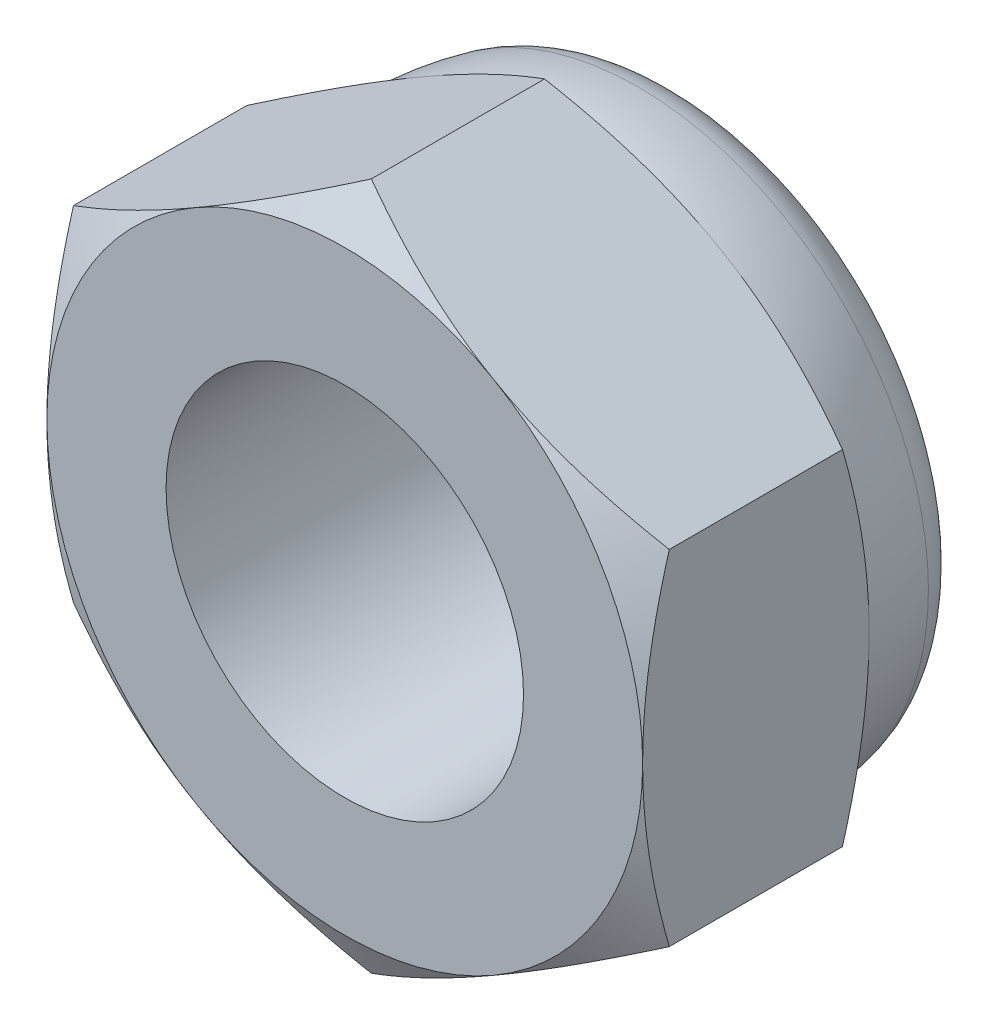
ISO-10303-21;
HEADER;
FILE_DESCRIPTION(('STEP AP214'),'2;1');
FILE_NAME('part.step','',(''),(''),'','','');
FILE_SCHEMA(('AUTOMOTIVE_DESIGN { 1 0 10303 214 1 1 1 1 }'));
ENDSEC;
DATA;
#1=APPLICATION_CONTEXT('core data for automotive mechanical design processes');
#2=APPLICATION_PROTOCOL_DEFINITION('international standard','automotive_design',2000,#1);
#3=PRODUCT_CONTEXT('',#1,'mechanical');
#4=PRODUCT('Part','Part','',(#3));
#5=PRODUCT_RELATED_PRODUCT_CATEGORY('part','',(#4));
#6=PRODUCT_DEFINITION_FORMATION('','',#4);
#7=PRODUCT_DEFINITION_CONTEXT('part definition',#1,'design');
#8=PRODUCT_DEFINITION('design','',#6,#7);
#9=PRODUCT_DEFINITION_SHAPE('','',#8);
#10=(LENGTH_UNIT() NAMED_UNIT(*) SI_UNIT(.MILLI.,.METRE.));
#11=(NAMED_UNIT(*) PLANE_ANGLE_UNIT() SI_UNIT($,.RADIAN.));
#12=(NAMED_UNIT(*) SI_UNIT($,.STERADIAN.) SOLID_ANGLE_UNIT());
#13=UNCERTAINTY_MEASURE_WITH_UNIT(LENGTH_MEASURE(1.E-05),#10,'distance_accuracy_value','');
#14=(GEOMETRIC_REPRESENTATION_CONTEXT(3) GLOBAL_UNCERTAINTY_ASSIGNED_CONTEXT((#13)) GLOBAL_UNIT_ASSIGNED_CONTEXT((#10,
#11,#12)) REPRESENTATION_CONTEXT('',''));
#15=CARTESIAN_POINT('',(0.,0.,0.));
#16=DIRECTION('',(0.,0.,1.));
#17=DIRECTION('',(1.,0.,0.));
#18=AXIS2_PLACEMENT_3D('',#15,#16,#17);
#19=CARTESIAN_POINT('',(0.,0.,-5.7));
#20=DIRECTION('',(0.,0.,1.));
#21=DIRECTION('',(1.,0.,0.));
#22=AXIS2_PLACEMENT_3D('',#19,#20,#21);
#23=CYLINDRICAL_SURFACE('',#22,3.);
#24=CARTESIAN_POINT('',(0.,0.,0.));
#25=DIRECTION('',(0.,0.,1.));
#26=DIRECTION('',(1.,0.,0.));
#27=AXIS2_PLACEMENT_3D('',#24,#25,#26);
#28=CIRCLE('',#27,3.);
#29=CARTESIAN_POINT('',(3.,0.,0.));
#30=VERTEX_POINT('',#29);
#31=EDGE_CURVE('E161',#30,#30,#28,.T.);
#32=ORIENTED_EDGE('',*,*,#31,.T.);
#33=EDGE_LOOP('',(#32));
#34=FACE_BOUND('',#33,.T.);
#35=CARTESIAN_POINT('',(0.,0.,-4.3));
#36=DIRECTION('',(0.,0.,-1.));
#37=DIRECTION('',(-1.,0.,0.));
#38=AXIS2_PLACEMENT_3D('',#35,#36,#37);
#39=CIRCLE('',#38,3.);
#40=CARTESIAN_POINT('',(-3.,0.,-4.3));
#41=VERTEX_POINT('',#40);
#42=EDGE_CURVE('E11',#41,#41,#39,.F.);
#43=ORIENTED_EDGE('',*,*,#42,.F.);
#44=EDGE_LOOP('',(#43));
#45=FACE_BOUND('',#44,.T.);
#46=ADVANCED_FACE('F34',(#34,#45),#23,.F.);
#47=CARTESIAN_POINT('',(-5.,8.66025403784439,0.));
#48=DIRECTION('',(0.,0.,-1.));
#49=DIRECTION('',(-1.,0.,0.));
#50=AXIS2_PLACEMENT_3D('',#47,#48,#49);
#51=PLANE('',#50);
#52=ORIENTED_EDGE('',*,*,#31,.F.);
#53=EDGE_LOOP('',(#52));
#54=FACE_BOUND('',#53,.T.);
#55=CARTESIAN_POINT('',(0.,0.,0.));
#56=DIRECTION('',(0.,0.,-1.));
#57=DIRECTION('',(-1.,0.,0.));
#58=AXIS2_PLACEMENT_3D('',#55,#56,#57);
#59=CIRCLE('',#58,5.);
#60=CARTESIAN_POINT('',(-5.,0.,0.));
#61=VERTEX_POINT('',#60);
#62=CARTESIAN_POINT('',(-2.5,4.3301270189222,0.));
#63=VERTEX_POINT('',#62);
#64=EDGE_CURVE('E160',#61,#63,#59,.T.);
#65=ORIENTED_EDGE('',*,*,#64,.F.);
#66=CARTESIAN_POINT('',(0.,0.,0.));
#67=DIRECTION('',(0.,0.,-1.));
#68=DIRECTION('',(-1.,0.,0.));
#69=AXIS2_PLACEMENT_3D('',#66,#67,#68);
#70=CIRCLE('',#69,5.);
#71=CARTESIAN_POINT('',(-2.5,-4.3301270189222,0.));
#72=VERTEX_POINT('',#71);
#73=EDGE_CURVE('E148',#61,#72,#70,.F.);
#74=ORIENTED_EDGE('',*,*,#73,.T.);
#75=CARTESIAN_POINT('',(2.5,-4.3301270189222,0.));
#76=VERTEX_POINT('',#75);
#77=EDGE_CURVE('E266',#72,#76,#70,.F.);
#78=ORIENTED_EDGE('',*,*,#77,.T.);
#79=CARTESIAN_POINT('',(5.,0.,0.));
#80=VERTEX_POINT('',#79);
#81=EDGE_CURVE('E557',#76,#80,#70,.F.);
#82=ORIENTED_EDGE('',*,*,#81,.T.);
#83=CARTESIAN_POINT('',(2.5,4.3301270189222,0.));
#84=VERTEX_POINT('',#83);
#85=EDGE_CURVE('E556',#80,#84,#70,.F.);
#86=ORIENTED_EDGE('',*,*,#85,.T.);
#87=EDGE_CURVE('E252',#84,#63,#70,.F.);
#88=ORIENTED_EDGE('',*,*,#87,.T.);
#89=EDGE_LOOP('',(#65,#74,#78,#82,#86,#88));
#90=FACE_BOUND('',#89,.T.);
#91=ADVANCED_FACE('F190',(#54,#90),#51,.F.);
#92=CARTESIAN_POINT('',(0.,0.,0.));
#93=DIRECTION('',(0.,0.,-1.));
#94=DIRECTION('',(-1.,0.,0.));
#95=AXIS2_PLACEMENT_3D('',#92,#93,#94);
#96=CONICAL_SURFACE('',#95,5.,1.0471975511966);
#97=CARTESIAN_POINT('',(-5.,-7.85952446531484,-2.49135627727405));
#98=CARTESIAN_POINT('',(-5.,-7.64024119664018,-2.38456490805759));
#99=CARTESIAN_POINT('',(-5.,-7.42046573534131,-2.27876743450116));
#100=CARTESIAN_POINT('',(-5.,-6.97966908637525,-2.06971720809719));
#101=CARTESIAN_POINT('',(-5.,-6.75864771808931,-1.9664648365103));
#102=CARTESIAN_POINT('',(-5.,-6.31400877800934,-1.76256455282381));
#103=CARTESIAN_POINT('',(-5.,-6.09038368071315,-1.66193299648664));
#104=CARTESIAN_POINT('',(-5.,-5.64139140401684,-1.46464945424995));
#105=CARTESIAN_POINT('',(-5.,-5.41602430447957,-1.36799728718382));
#106=CARTESIAN_POINT('',(-5.,-4.95550995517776,-1.17652649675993));
#107=CARTESIAN_POINT('',(-5.,-4.72029024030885,-1.08188123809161));
#108=CARTESIAN_POINT('',(-5.,-4.2471379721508,-0.89950202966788));
#109=CARTESIAN_POINT('',(-5.,-4.00920512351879,-0.811768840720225));
#110=CARTESIAN_POINT('',(-5.,-3.53066047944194,-0.645440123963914));
#111=CARTESIAN_POINT('',(-5.,-3.29005487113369,-0.566826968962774));
#112=CARTESIAN_POINT('',(-5.,-2.80539335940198,-0.421191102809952));
#113=CARTESIAN_POINT('',(-5.,-2.5613385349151,-0.354164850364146));
#114=CARTESIAN_POINT('',(-5.,-2.07102262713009,-0.235213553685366));
#115=CARTESIAN_POINT('',(-5.,-1.82478280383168,-0.183202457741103));
#116=CARTESIAN_POINT('',(-5.,-1.3291329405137,-0.0971416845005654));
#117=CARTESIAN_POINT('',(-5.,-1.07972323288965,-0.0630901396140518));
#118=CARTESIAN_POINT('',(-5.,-0.582278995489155,-0.0161056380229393));
#119=CARTESIAN_POINT('',(-5.,-0.33427154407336,-0.00289307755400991));
#120=CARTESIAN_POINT('',(-5.,0.161980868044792,0.00203623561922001));
#121=CARTESIAN_POINT('',(-5.,0.410225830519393,-0.00624717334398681));
#122=CARTESIAN_POINT('',(-5.,0.828609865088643,-0.0377266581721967));
#123=CARTESIAN_POINT('',(-5.,0.999182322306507,-0.0555241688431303));
#124=CARTESIAN_POINT('',(-5.,1.33913929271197,-0.100215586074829));
#125=CARTESIAN_POINT('',(-5.,1.50852365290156,-0.127110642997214));
#126=CARTESIAN_POINT('',(-5.,2.01463578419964,-0.220034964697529));
#127=CARTESIAN_POINT('',(-5.,2.34914750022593,-0.298288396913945));
#128=CARTESIAN_POINT('',(-5.,2.84947055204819,-0.43475362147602));
#129=CARTESIAN_POINT('',(-5.,3.01785451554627,-0.484077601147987));
#130=CARTESIAN_POINT('',(-5.,3.35298887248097,-0.588042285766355));
#131=CARTESIAN_POINT('',(-5.,3.51973925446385,-0.642683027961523));
#132=CARTESIAN_POINT('',(-5.,3.851655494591,-0.756388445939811));
#133=CARTESIAN_POINT('',(-5.,4.01682180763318,-0.815451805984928));
#134=CARTESIAN_POINT('',(-5.,4.34577319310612,-0.937288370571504));
#135=CARTESIAN_POINT('',(-5.,4.50955828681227,-1.00006151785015));
#136=CARTESIAN_POINT('',(-5.,4.9145081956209,-1.1596926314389));
#137=CARTESIAN_POINT('',(-5.,5.15494160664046,-1.25840324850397));
#138=CARTESIAN_POINT('',(-5.,5.63359045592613,-1.46107987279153));
#139=CARTESIAN_POINT('',(-5.,5.87180571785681,-1.56504629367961));
#140=CARTESIAN_POINT('',(-5.,6.34645664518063,-1.77711400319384));
#141=CARTESIAN_POINT('',(-5.,6.58289183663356,-1.88521634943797));
#142=CARTESIAN_POINT('',(-5.,7.05424983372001,-2.10467573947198));
#143=CARTESIAN_POINT('',(-5.,7.28917260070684,-2.216032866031));
#144=CARTESIAN_POINT('',(-5.,7.75806132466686,-2.44149585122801));
#145=CARTESIAN_POINT('',(-5.,7.99202568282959,-2.55560502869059));
#146=CARTESIAN_POINT('',(-5.,8.45890841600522,-2.78594562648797));
#147=CARTESIAN_POINT('',(-5.,8.69182678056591,-2.90217706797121));
#148=CARTESIAN_POINT('',(-5.,9.38919926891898,-3.25342076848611));
#149=CARTESIAN_POINT('',(-5.,9.85234973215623,-3.49102070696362));
#150=CARTESIAN_POINT('',(-5.,10.7338003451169,-3.94896948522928));
#151=CARTESIAN_POINT('',(-5.,11.1523179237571,-4.16890179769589));
#152=CARTESIAN_POINT('',(-5.,11.987820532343,-4.61170154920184));
#153=CARTESIAN_POINT('',(-5.,12.4048054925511,-4.83456911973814));
#154=CARTESIAN_POINT('',(-5.,13.2363852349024,-5.28186905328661));
#155=CARTESIAN_POINT('',(-5.,13.6509834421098,-5.50629505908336));
#156=CARTESIAN_POINT('',(-5.,14.4792101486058,-5.95686657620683));
#157=CARTESIAN_POINT('',(-5.,14.8928387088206,-6.18301197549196));
#158=CARTESIAN_POINT('',(-5.,15.30611626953,-6.40979272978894));
#159=B_SPLINE_CURVE_WITH_KNOTS('',3,(#97,#98,#99,#100,#101,#102,#103,#104,#105,#106,#107,#108,
#109,#110,#111,#112,#113,#114,#115,#116,#117,#118,#119,#120,#121,#122,#123,#124,#125,#126,#127,
#128,#129,#130,#131,#132,#133,#134,#135,#136,#137,#138,#139,#140,#141,#142,#143,#144,#145,#146,
#147,#148,#149,#150,#151,#152,#153,#154,#155,#156,#157,#158),.UNSPECIFIED.,.F.,.F.,(4,2,2,2,2,2,
2,2,2,2,2,2,2,2,2,2,2,2,2,2,2,2,2,2,2,2,2,2,2,2,4),(0.,0.731722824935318,1.46355460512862,
2.19919601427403,2.93480389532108,3.69536062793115,4.45600095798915,5.21514572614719,
5.97405806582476,6.72853058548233,7.48292463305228,8.22710789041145,8.97129674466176,
9.48554450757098,9.99985732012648,11.0290077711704,11.5553386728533,12.0816732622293,
12.607851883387,13.1340223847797,13.9136581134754,14.6933553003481,15.473253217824,
16.2531709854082,17.034081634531,17.8150000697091,19.3765737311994,20.7949213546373,
22.2133327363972,23.6276580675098,25.0418920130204),.UNSPECIFIED.);
#160=CARTESIAN_POINT('',(-5.,2.88675134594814,-0.446581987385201));
#161=VERTEX_POINT('',#160);
#162=EDGE_CURVE('E177',#161,#61,#159,.F.);
#163=ORIENTED_EDGE('',*,*,#162,.T.);
#164=ORIENTED_EDGE('',*,*,#64,.T.);
#165=CARTESIAN_POINT('',(0.0002,5.7736181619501,-0.446648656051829));
#166=CARTESIAN_POINT('',(-0.219534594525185,5.64675433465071,-0.373386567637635));
#167=CARTESIAN_POINT('',(-0.441148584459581,5.5188054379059,-0.306751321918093));
#168=CARTESIAN_POINT('',(-0.888213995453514,5.26069210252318,-0.190438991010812));
#169=CARTESIAN_POINT('',(-1.11367335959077,5.13052307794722,-0.140803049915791));
#170=CARTESIAN_POINT('',(-1.56183230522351,4.87177839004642,-0.063551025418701));
#171=CARTESIAN_POINT('',(-1.78446209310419,4.74324302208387,-0.035420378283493));
#172=CARTESIAN_POINT('',(-2.11918990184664,4.54998783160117,-0.0101949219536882));
#173=CARTESIAN_POINT('',(-2.23084219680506,4.48552534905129,-0.00461345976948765));
#174=CARTESIAN_POINT('',(-2.4542499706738,4.35654081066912,0.000797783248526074));
#175=CARTESIAN_POINT('',(-2.56600544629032,4.29201875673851,0.000627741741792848));
#176=CARTESIAN_POINT('',(-2.87218423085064,4.11524635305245,-0.00775363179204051));
#177=CARTESIAN_POINT('',(-3.06650608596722,4.00305457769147,-0.0218297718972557));
#178=CARTESIAN_POINT('',(-3.45386010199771,3.77941563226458,-0.0664652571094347));
#179=CARTESIAN_POINT('',(-3.64689090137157,3.66796924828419,-0.0970398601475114));
#180=CARTESIAN_POINT('',(-4.03502534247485,3.44387972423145,-0.173468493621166));
#181=CARTESIAN_POINT('',(-4.23007999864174,3.33126486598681,-0.219646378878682));
#182=CARTESIAN_POINT('',(-4.61728034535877,3.10771464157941,-0.324451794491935));
#183=CARTESIAN_POINT('',(-4.80943099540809,2.99677641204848,-0.383054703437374));
#184=CARTESIAN_POINT('',(-5.0002,2.8866358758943,-0.446648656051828));
#185=B_SPLINE_CURVE_WITH_KNOTS('',3,(#165,#166,#167,#168,#169,#170,#171,#172,#173,#174,#175,
#176,#177,#178,#179,#180,#181,#182,#183,#184),.UNSPECIFIED.,.F.,.F.,(4,2,2,2,2,2,2,2,2,4),(0.,
0.79255584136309,1.58701660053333,2.36181537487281,2.74884076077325,3.13585419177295,
3.80962362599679,4.48401723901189,5.17336882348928,5.86136694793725),.UNSPECIFIED.);
#186=EDGE_CURVE('E164',#63,#161,#185,.T.);
#187=ORIENTED_EDGE('',*,*,#186,.T.);
#188=EDGE_LOOP('',(#163,#164,#187));
#189=FACE_BOUND('',#188,.T.);
#190=ADVANCED_FACE('F184',(#189),#96,.T.);
#191=CARTESIAN_POINT('',(5.0002,2.8866358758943,-0.446648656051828));
#192=CARTESIAN_POINT('',(4.78046540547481,3.01349970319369,-0.373386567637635));
#193=CARTESIAN_POINT('',(4.55885141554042,3.1414485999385,-0.306751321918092));
#194=CARTESIAN_POINT('',(4.11178600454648,3.39956193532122,-0.190438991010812));
#195=CARTESIAN_POINT('',(3.88632664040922,3.52973095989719,-0.140803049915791));
#196=CARTESIAN_POINT('',(3.43816769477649,3.78847564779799,-0.063551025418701));
#197=CARTESIAN_POINT('',(3.2155379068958,3.91701101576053,-0.035420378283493));
#198=CARTESIAN_POINT('',(2.88081009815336,4.11026620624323,-0.0101949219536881));
#199=CARTESIAN_POINT('',(2.76915780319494,4.17472868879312,-0.00461345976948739));
#200=CARTESIAN_POINT('',(2.5457500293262,4.30371322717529,0.000797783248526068));
#201=CARTESIAN_POINT('',(2.43399455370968,4.3682352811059,0.000627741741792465));
#202=CARTESIAN_POINT('',(2.12781576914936,4.54500768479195,-0.00775363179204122));
#203=CARTESIAN_POINT('',(1.93349391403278,4.65719946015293,-0.0218297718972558));
#204=CARTESIAN_POINT('',(1.54613989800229,4.88083840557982,-0.0664652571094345));
#205=CARTESIAN_POINT('',(1.35310909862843,4.99228478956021,-0.0970398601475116));
#206=CARTESIAN_POINT('',(0.964974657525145,5.21637431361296,-0.173468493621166));
#207=CARTESIAN_POINT('',(0.769920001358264,5.32898917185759,-0.219646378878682));
#208=CARTESIAN_POINT('',(0.382719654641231,5.55253939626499,-0.324451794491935));
#209=CARTESIAN_POINT('',(0.190569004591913,5.66347762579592,-0.383054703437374));
#210=CARTESIAN_POINT('',(-0.000199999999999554,5.7736181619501,-0.446648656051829));
#211=B_SPLINE_CURVE_WITH_KNOTS('',3,(#191,#192,#193,#194,#195,#196,#197,#198,#199,#200,#201,
#202,#203,#204,#205,#206,#207,#208,#209,#210),.UNSPECIFIED.,.F.,.F.,(4,2,2,2,2,2,2,2,2,4),(0.,
0.792555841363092,1.58701660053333,2.36181537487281,2.74884076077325,3.13585419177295,
3.80962362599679,4.48401723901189,5.17336882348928,5.86136694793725),.UNSPECIFIED.);
#212=CARTESIAN_POINT('',(0.,5.77350269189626,-0.446581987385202));
#213=VERTEX_POINT('',#212);
#214=EDGE_CURVE('E202',#84,#213,#211,.T.);
#215=ORIENTED_EDGE('',*,*,#214,.T.);
#216=EDGE_CURVE('E176',#213,#63,#185,.T.);
#217=ORIENTED_EDGE('',*,*,#216,.T.);
#218=ORIENTED_EDGE('',*,*,#87,.F.);
#219=EDGE_LOOP('',(#215,#217,#218));
#220=FACE_BOUND('',#219,.T.);
#221=ADVANCED_FACE('F189',(#220),#96,.T.);
#222=CARTESIAN_POINT('',(5.,-7.85952446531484,-2.49135627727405));
#223=CARTESIAN_POINT('',(5.,-7.64024119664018,-2.38456490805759));
#224=CARTESIAN_POINT('',(5.,-7.42046573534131,-2.27876743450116));
#225=CARTESIAN_POINT('',(5.,-6.97966908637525,-2.06971720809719));
#226=CARTESIAN_POINT('',(5.,-6.75864771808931,-1.9664648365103));
#227=CARTESIAN_POINT('',(5.,-6.31400877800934,-1.76256455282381));
#228=CARTESIAN_POINT('',(5.,-6.09038368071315,-1.66193299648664));
#229=CARTESIAN_POINT('',(5.,-5.64139140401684,-1.46464945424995));
#230=CARTESIAN_POINT('',(5.,-5.41602430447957,-1.36799728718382));
#231=CARTESIAN_POINT('',(5.,-4.95550995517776,-1.17652649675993));
#232=CARTESIAN_POINT('',(5.,-4.72029024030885,-1.08188123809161));
#233=CARTESIAN_POINT('',(5.,-4.2471379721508,-0.89950202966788));
#234=CARTESIAN_POINT('',(5.,-4.00920512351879,-0.811768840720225));
#235=CARTESIAN_POINT('',(5.,-3.53066047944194,-0.645440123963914));
#236=CARTESIAN_POINT('',(5.,-3.29005487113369,-0.566826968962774));
#237=CARTESIAN_POINT('',(5.,-2.80539335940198,-0.421191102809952));
#238=CARTESIAN_POINT('',(5.,-2.5613385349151,-0.354164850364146));
#239=CARTESIAN_POINT('',(5.,-2.07102262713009,-0.235213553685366));
#240=CARTESIAN_POINT('',(5.,-1.82478280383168,-0.183202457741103));
#241=CARTESIAN_POINT('',(5.,-1.3291329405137,-0.0971416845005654));
#242=CARTESIAN_POINT('',(5.,-1.07972323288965,-0.0630901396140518));
#243=CARTESIAN_POINT('',(5.,-0.582278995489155,-0.0161056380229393));
#244=CARTESIAN_POINT('',(5.,-0.33427154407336,-0.00289307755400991));
#245=CARTESIAN_POINT('',(5.,0.161980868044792,0.00203623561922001));
#246=CARTESIAN_POINT('',(5.,0.410225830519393,-0.00624717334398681));
#247=CARTESIAN_POINT('',(5.,0.828609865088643,-0.0377266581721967));
#248=CARTESIAN_POINT('',(5.,0.999182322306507,-0.0555241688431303));
#249=CARTESIAN_POINT('',(5.,1.33913929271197,-0.100215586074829));
#250=CARTESIAN_POINT('',(5.,1.50852365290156,-0.127110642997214));
#251=CARTESIAN_POINT('',(5.,2.01463578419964,-0.220034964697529));
#252=CARTESIAN_POINT('',(5.,2.34914750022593,-0.298288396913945));
#253=CARTESIAN_POINT('',(5.,2.84947055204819,-0.43475362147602));
#254=CARTESIAN_POINT('',(5.,3.01785451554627,-0.484077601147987));
#255=CARTESIAN_POINT('',(5.,3.35298887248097,-0.588042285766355));
#256=CARTESIAN_POINT('',(5.,3.51973925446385,-0.642683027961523));
#257=CARTESIAN_POINT('',(5.,3.851655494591,-0.756388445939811));
#258=CARTESIAN_POINT('',(5.,4.01682180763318,-0.815451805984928));
#259=CARTESIAN_POINT('',(5.,4.34577319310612,-0.937288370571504));
#260=CARTESIAN_POINT('',(5.,4.50955828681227,-1.00006151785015));
#261=CARTESIAN_POINT('',(5.,4.9145081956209,-1.1596926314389));
#262=CARTESIAN_POINT('',(5.,5.15494160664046,-1.25840324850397));
#263=CARTESIAN_POINT('',(5.,5.63359045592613,-1.46107987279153));
#264=CARTESIAN_POINT('',(5.,5.87180571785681,-1.56504629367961));
#265=CARTESIAN_POINT('',(5.,6.34645664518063,-1.77711400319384));
#266=CARTESIAN_POINT('',(5.,6.58289183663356,-1.88521634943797));
#267=CARTESIAN_POINT('',(5.,7.05424983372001,-2.10467573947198));
#268=CARTESIAN_POINT('',(5.,7.28917260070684,-2.216032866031));
#269=CARTESIAN_POINT('',(5.,7.75806132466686,-2.44149585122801));
#270=CARTESIAN_POINT('',(5.,7.99202568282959,-2.55560502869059));
#271=CARTESIAN_POINT('',(5.,8.45890841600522,-2.78594562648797));
#272=CARTESIAN_POINT('',(5.,8.69182678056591,-2.90217706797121));
#273=CARTESIAN_POINT('',(5.,9.38919926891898,-3.25342076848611));
#274=CARTESIAN_POINT('',(5.,9.85234973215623,-3.49102070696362));
#275=CARTESIAN_POINT('',(5.,10.7338003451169,-3.94896948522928));
#276=CARTESIAN_POINT('',(5.,11.1523179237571,-4.16890179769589));
#277=CARTESIAN_POINT('',(5.,11.987820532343,-4.61170154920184));
#278=CARTESIAN_POINT('',(5.,12.4048054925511,-4.83456911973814));
#279=CARTESIAN_POINT('',(5.,13.2363852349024,-5.28186905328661));
#280=CARTESIAN_POINT('',(5.,13.6509834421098,-5.50629505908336));
#281=CARTESIAN_POINT('',(5.,14.4792101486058,-5.95686657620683));
#282=CARTESIAN_POINT('',(5.,14.8928387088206,-6.18301197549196));
#283=CARTESIAN_POINT('',(5.,15.30611626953,-6.40979272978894));
#284=B_SPLINE_CURVE_WITH_KNOTS('',3,(#222,#223,#224,#225,#226,#227,#228,#229,#230,#231,#232,
#233,#234,#235,#236,#237,#238,#239,#240,#241,#242,#243,#244,#245,#246,#247,#248,#249,#250,#251,
#252,#253,#254,#255,#256,#257,#258,#259,#260,#261,#262,#263,#264,#265,#266,#267,#268,#269,#270,
#271,#272,#273,#274,#275,#276,#277,#278,#279,#280,#281,#282,#283),.UNSPECIFIED.,.F.,.F.,(4,2,2,
2,2,2,2,2,2,2,2,2,2,2,2,2,2,2,2,2,2,2,2,2,2,2,2,2,2,2,4),(0.,0.731722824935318,1.46355460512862,
2.19919601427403,2.93480389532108,3.69536062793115,4.45600095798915,5.21514572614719,
5.97405806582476,6.72853058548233,7.48292463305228,8.22710789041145,8.97129674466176,
9.48554450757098,9.99985732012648,11.0290077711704,11.5553386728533,12.0816732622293,
12.607851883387,13.1340223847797,13.9136581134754,14.6933553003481,15.473253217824,
16.2531709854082,17.034081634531,17.8150000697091,19.3765737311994,20.7949213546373,
22.2133327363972,23.6276580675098,25.0418920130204),.UNSPECIFIED.);
#285=CARTESIAN_POINT('',(5.,2.88675134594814,-0.446581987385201));
#286=VERTEX_POINT('',#285);
#287=EDGE_CURVE('E213',#80,#286,#284,.T.);
#288=ORIENTED_EDGE('',*,*,#287,.T.);
#289=EDGE_CURVE('E526',#286,#84,#211,.T.);
#290=ORIENTED_EDGE('',*,*,#289,.T.);
#291=ORIENTED_EDGE('',*,*,#85,.F.);
#292=EDGE_LOOP('',(#288,#290,#291));
#293=FACE_BOUND('',#292,.T.);
#294=ADVANCED_FACE('F389',(#293),#96,.T.);
#295=CARTESIAN_POINT('',(-0.0002,-5.7736181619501,-0.446648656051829));
#296=CARTESIAN_POINT('',(0.219534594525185,-5.64675433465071,-0.373386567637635));
#297=CARTESIAN_POINT('',(0.441148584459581,-5.5188054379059,-0.306751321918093));
#298=CARTESIAN_POINT('',(0.888213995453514,-5.26069210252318,-0.190438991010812));
#299=CARTESIAN_POINT('',(1.11367335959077,-5.13052307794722,-0.140803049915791));
#300=CARTESIAN_POINT('',(1.56183230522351,-4.87177839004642,-0.063551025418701));
#301=CARTESIAN_POINT('',(1.78446209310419,-4.74324302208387,-0.035420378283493));
#302=CARTESIAN_POINT('',(2.11918990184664,-4.54998783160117,-0.0101949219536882));
#303=CARTESIAN_POINT('',(2.23084219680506,-4.48552534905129,-0.00461345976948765));
#304=CARTESIAN_POINT('',(2.4542499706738,-4.35654081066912,0.000797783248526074));
#305=CARTESIAN_POINT('',(2.56600544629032,-4.29201875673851,0.000627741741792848));
#306=CARTESIAN_POINT('',(2.87218423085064,-4.11524635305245,-0.00775363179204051));
#307=CARTESIAN_POINT('',(3.06650608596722,-4.00305457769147,-0.0218297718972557));
#308=CARTESIAN_POINT('',(3.45386010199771,-3.77941563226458,-0.0664652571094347));
#309=CARTESIAN_POINT('',(3.64689090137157,-3.66796924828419,-0.0970398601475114));
#310=CARTESIAN_POINT('',(4.03502534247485,-3.44387972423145,-0.173468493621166));
#311=CARTESIAN_POINT('',(4.23007999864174,-3.33126486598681,-0.219646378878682));
#312=CARTESIAN_POINT('',(4.61728034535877,-3.10771464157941,-0.324451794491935));
#313=CARTESIAN_POINT('',(4.80943099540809,-2.99677641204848,-0.383054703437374));
#314=CARTESIAN_POINT('',(5.0002,-2.8866358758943,-0.446648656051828));
#315=B_SPLINE_CURVE_WITH_KNOTS('',3,(#295,#296,#297,#298,#299,#300,#301,#302,#303,#304,#305,
#306,#307,#308,#309,#310,#311,#312,#313,#314),.UNSPECIFIED.,.F.,.F.,(4,2,2,2,2,2,2,2,2,4),(0.,
0.79255584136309,1.58701660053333,2.36181537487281,2.74884076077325,3.13585419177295,
3.80962362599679,4.48401723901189,5.17336882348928,5.86136694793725),.UNSPECIFIED.);
#316=CARTESIAN_POINT('',(5.,-2.88675134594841,-0.446581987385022));
#317=VERTEX_POINT('',#316);
#318=EDGE_CURVE('E219',#76,#317,#315,.T.);
#319=ORIENTED_EDGE('',*,*,#318,.T.);
#320=EDGE_CURVE('E218',#317,#80,#284,.T.);
#321=ORIENTED_EDGE('',*,*,#320,.T.);
#322=ORIENTED_EDGE('',*,*,#81,.F.);
#323=EDGE_LOOP('',(#319,#321,#322));
#324=FACE_BOUND('',#323,.T.);
#325=ADVANCED_FACE('F397',(#324),#96,.T.);
#326=CARTESIAN_POINT('',(0.,-5.77350269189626,-0.446581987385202));
#327=VERTEX_POINT('',#326);
#328=EDGE_CURVE('E137',#327,#76,#315,.T.);
#329=ORIENTED_EDGE('',*,*,#328,.T.);
#330=ORIENTED_EDGE('',*,*,#77,.F.);
#331=CARTESIAN_POINT('',(-5.0002,-2.8866358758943,-0.446648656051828));
#332=CARTESIAN_POINT('',(-4.78046540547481,-3.01349970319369,-0.373386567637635));
#333=CARTESIAN_POINT('',(-4.55885141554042,-3.1414485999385,-0.306751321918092));
#334=CARTESIAN_POINT('',(-4.11178600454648,-3.39956193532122,-0.190438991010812));
#335=CARTESIAN_POINT('',(-3.88632664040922,-3.52973095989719,-0.140803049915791));
#336=CARTESIAN_POINT('',(-3.43816769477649,-3.78847564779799,-0.063551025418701));
#337=CARTESIAN_POINT('',(-3.2155379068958,-3.91701101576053,-0.035420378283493));
#338=CARTESIAN_POINT('',(-2.88081009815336,-4.11026620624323,-0.0101949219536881));
#339=CARTESIAN_POINT('',(-2.76915780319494,-4.17472868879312,-0.00461345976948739));
#340=CARTESIAN_POINT('',(-2.5457500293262,-4.30371322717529,0.000797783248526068));
#341=CARTESIAN_POINT('',(-2.43399455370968,-4.3682352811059,0.000627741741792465));
#342=CARTESIAN_POINT('',(-2.12781576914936,-4.54500768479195,-0.00775363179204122));
#343=CARTESIAN_POINT('',(-1.93349391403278,-4.65719946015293,-0.0218297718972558));
#344=CARTESIAN_POINT('',(-1.54613989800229,-4.88083840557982,-0.0664652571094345));
#345=CARTESIAN_POINT('',(-1.35310909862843,-4.99228478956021,-0.0970398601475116));
#346=CARTESIAN_POINT('',(-0.964974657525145,-5.21637431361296,-0.173468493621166));
#347=CARTESIAN_POINT('',(-0.769920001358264,-5.32898917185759,-0.219646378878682));
#348=CARTESIAN_POINT('',(-0.382719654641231,-5.55253939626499,-0.324451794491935));
#349=CARTESIAN_POINT('',(-0.190569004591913,-5.66347762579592,-0.383054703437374));
#350=CARTESIAN_POINT('',(0.000199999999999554,-5.7736181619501,-0.446648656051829));
#351=B_SPLINE_CURVE_WITH_KNOTS('',3,(#331,#332,#333,#334,#335,#336,#337,#338,#339,#340,#341,
#342,#343,#344,#345,#346,#347,#348,#349,#350),.UNSPECIFIED.,.F.,.F.,(4,2,2,2,2,2,2,2,2,4),(0.,
0.792555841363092,1.58701660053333,2.36181537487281,2.74884076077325,3.13585419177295,
3.80962362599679,4.48401723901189,5.17336882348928,5.86136694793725),.UNSPECIFIED.);
#352=EDGE_CURVE('E522',#72,#327,#351,.T.);
#353=ORIENTED_EDGE('',*,*,#352,.T.);
#354=EDGE_LOOP('',(#329,#330,#353));
#355=FACE_BOUND('',#354,.T.);
#356=ADVANCED_FACE('F192',(#355),#96,.T.);
#357=CARTESIAN_POINT('',(-5.,-2.88675134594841,-0.446581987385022));
#358=VERTEX_POINT('',#357);
#359=EDGE_CURVE('E207',#358,#72,#351,.T.);
#360=ORIENTED_EDGE('',*,*,#359,.T.);
#361=ORIENTED_EDGE('',*,*,#73,.F.);
#362=EDGE_CURVE('E524',#61,#358,#159,.F.);
#363=ORIENTED_EDGE('',*,*,#362,.T.);
#364=EDGE_LOOP('',(#360,#361,#363));
#365=FACE_BOUND('',#364,.T.);
#366=ADVANCED_FACE('F391',(#365),#96,.T.);
#367=CARTESIAN_POINT('',(5.,2.88675134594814,-3.8));
#368=DIRECTION('',(0.499999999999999,0.866025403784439,0.));
#369=DIRECTION('',(-0.866025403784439,0.5,0.));
#370=AXIS2_PLACEMENT_3D('',#367,#368,#369);
#371=PLANE('',#370);
#372=CARTESIAN_POINT('',(-0.0002,5.7736181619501,-3.35335134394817));
#373=CARTESIAN_POINT('',(0.219534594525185,5.64675433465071,-3.42661343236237));
#374=CARTESIAN_POINT('',(0.44114858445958,5.5188054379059,-3.49324867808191));
#375=CARTESIAN_POINT('',(0.888213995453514,5.26069210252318,-3.60956100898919));
#376=CARTESIAN_POINT('',(1.11367335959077,5.13052307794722,-3.65919695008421));
#377=CARTESIAN_POINT('',(1.56183230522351,4.87177839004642,-3.7364489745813));
#378=CARTESIAN_POINT('',(1.78446209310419,4.74324302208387,-3.76457962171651));
#379=CARTESIAN_POINT('',(2.11918990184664,4.54998783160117,-3.78980507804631));
#380=CARTESIAN_POINT('',(2.23084219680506,4.48552534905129,-3.79538654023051));
#381=CARTESIAN_POINT('',(2.4542499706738,4.35654081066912,-3.80079778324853));
#382=CARTESIAN_POINT('',(2.56600544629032,4.29201875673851,-3.80062774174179));
#383=CARTESIAN_POINT('',(2.87218423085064,4.11524635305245,-3.79224636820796));
#384=CARTESIAN_POINT('',(3.06650608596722,4.00305457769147,-3.77817022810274));
#385=CARTESIAN_POINT('',(3.45386010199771,3.77941563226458,-3.73353474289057));
#386=CARTESIAN_POINT('',(3.64689090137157,3.66796924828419,-3.70296013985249));
#387=CARTESIAN_POINT('',(4.03502534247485,3.44387972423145,-3.62653150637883));
#388=CARTESIAN_POINT('',(4.23007999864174,3.33126486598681,-3.58035362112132));
#389=CARTESIAN_POINT('',(4.61728034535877,3.10771464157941,-3.47554820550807));
#390=CARTESIAN_POINT('',(4.80943099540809,2.99677641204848,-3.41694529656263));
#391=CARTESIAN_POINT('',(5.0002,2.8866358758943,-3.35335134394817));
#392=B_SPLINE_CURVE_WITH_KNOTS('',3,(#372,#373,#374,#375,#376,#377,#378,#379,#380,#381,#382,
#383,#384,#385,#386,#387,#388,#389,#390,#391),.UNSPECIFIED.,.F.,.F.,(4,2,2,2,2,2,2,2,2,4),(0.,
0.79255584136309,1.58701660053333,2.36181537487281,2.74884076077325,3.13585419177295,
3.80962362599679,4.48401723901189,5.17336882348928,5.86136694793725),.UNSPECIFIED.);
#393=CARTESIAN_POINT('',(0.,5.77350269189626,-3.3534180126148));
#394=VERTEX_POINT('',#393);
#395=CARTESIAN_POINT('',(2.5,4.3301270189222,-3.8));
#396=VERTEX_POINT('',#395);
#397=EDGE_CURVE('E142',#394,#396,#392,.T.);
#398=ORIENTED_EDGE('',*,*,#397,.F.);
#399=DIRECTION('',(0.,0.,1.));
#400=VECTOR('',#399,1.);
#401=CARTESIAN_POINT('',(0.,5.77350269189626,-3.8));
#402=LINE('',#401,#400);
#403=EDGE_CURVE('E134',#394,#213,#402,.T.);
#404=ORIENTED_EDGE('',*,*,#403,.T.);
#405=ORIENTED_EDGE('',*,*,#214,.F.);
#406=ORIENTED_EDGE('',*,*,#289,.F.);
#407=DIRECTION('',(0.,0.,1.));
#408=VECTOR('',#407,1.);
#409=CARTESIAN_POINT('',(5.,2.88675134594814,-3.8));
#410=LINE('',#409,#408);
#411=CARTESIAN_POINT('',(5.,2.88675134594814,-3.3534180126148));
#412=VERTEX_POINT('',#411);
#413=EDGE_CURVE('E249',#412,#286,#410,.T.);
#414=ORIENTED_EDGE('',*,*,#413,.F.);
#415=EDGE_CURVE('E244',#396,#412,#392,.T.);
#416=ORIENTED_EDGE('',*,*,#415,.F.);
#417=EDGE_LOOP('',(#398,#404,#405,#406,#414,#416));
#418=FACE_BOUND('',#417,.T.);
#419=ADVANCED_FACE('F36',(#418),#371,.T.);
#420=CARTESIAN_POINT('',(5.,-2.88675134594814,-3.8));
#421=DIRECTION('',(1.,0.,0.));
#422=DIRECTION('',(0.,0.,-1.));
#423=AXIS2_PLACEMENT_3D('',#420,#421,#422);
#424=PLANE('',#423);
#425=CARTESIAN_POINT('',(5.,-7.85952446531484,-1.30864372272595));
#426=CARTESIAN_POINT('',(5.,-7.64024119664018,-1.41543509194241));
#427=CARTESIAN_POINT('',(5.,-7.42046573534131,-1.52123256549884));
#428=CARTESIAN_POINT('',(5.,-6.97966908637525,-1.73028279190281));
#429=CARTESIAN_POINT('',(5.,-6.75864771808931,-1.8335351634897));
#430=CARTESIAN_POINT('',(5.,-6.31400877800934,-2.03743544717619));
#431=CARTESIAN_POINT('',(5.,-6.09038368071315,-2.13806700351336));
#432=CARTESIAN_POINT('',(5.,-5.64139140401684,-2.33535054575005));
#433=CARTESIAN_POINT('',(5.,-5.41602430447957,-2.43200271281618));
#434=CARTESIAN_POINT('',(5.,-4.95550995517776,-2.62347350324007));
#435=CARTESIAN_POINT('',(5.,-4.72029024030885,-2.71811876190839));
#436=CARTESIAN_POINT('',(5.,-4.2471379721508,-2.90049797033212));
#437=CARTESIAN_POINT('',(5.,-4.00920512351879,-2.98823115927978));
#438=CARTESIAN_POINT('',(5.,-3.53066047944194,-3.15455987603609));
#439=CARTESIAN_POINT('',(5.,-3.29005487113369,-3.23317303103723));
#440=CARTESIAN_POINT('',(5.,-2.80539335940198,-3.37880889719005));
#441=CARTESIAN_POINT('',(5.,-2.5613385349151,-3.44583514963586));
#442=CARTESIAN_POINT('',(5.,-2.07102262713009,-3.56478644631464));
#443=CARTESIAN_POINT('',(5.,-1.82478280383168,-3.6167975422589));
#444=CARTESIAN_POINT('',(5.,-1.3291329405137,-3.70285831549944));
#445=CARTESIAN_POINT('',(5.,-1.07972323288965,-3.73690986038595));
#446=CARTESIAN_POINT('',(5.,-0.582278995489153,-3.78389436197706));
#447=CARTESIAN_POINT('',(5.,-0.334271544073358,-3.79710692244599));
#448=CARTESIAN_POINT('',(5.,0.161980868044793,-3.80203623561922));
#449=CARTESIAN_POINT('',(5.,0.410225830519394,-3.79375282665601));
#450=CARTESIAN_POINT('',(5.,0.828609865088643,-3.7622733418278));
#451=CARTESIAN_POINT('',(5.,0.999182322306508,-3.74447583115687));
#452=CARTESIAN_POINT('',(5.,1.33913929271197,-3.69978441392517));
#453=CARTESIAN_POINT('',(5.,1.50852365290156,-3.67288935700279));
#454=CARTESIAN_POINT('',(5.,2.01463578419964,-3.57996503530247));
#455=CARTESIAN_POINT('',(5.,2.34914750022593,-3.50171160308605));
#456=CARTESIAN_POINT('',(5.,2.84947055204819,-3.36524637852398));
#457=CARTESIAN_POINT('',(5.,3.01785451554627,-3.31592239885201));
#458=CARTESIAN_POINT('',(5.,3.35298887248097,-3.21195771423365));
#459=CARTESIAN_POINT('',(5.,3.51973925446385,-3.15731697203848));
#460=CARTESIAN_POINT('',(5.,3.851655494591,-3.04361155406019));
#461=CARTESIAN_POINT('',(5.,4.01682180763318,-2.98454819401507));
#462=CARTESIAN_POINT('',(5.,4.34577319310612,-2.8627116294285));
#463=CARTESIAN_POINT('',(5.,4.50955828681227,-2.79993848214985));
#464=CARTESIAN_POINT('',(5.,4.9145081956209,-2.6403073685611));
#465=CARTESIAN_POINT('',(5.,5.15494160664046,-2.54159675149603));
#466=CARTESIAN_POINT('',(5.,5.63359045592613,-2.33892012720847));
#467=CARTESIAN_POINT('',(5.,5.87180571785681,-2.23495370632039));
#468=CARTESIAN_POINT('',(5.,6.34645664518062,-2.02288599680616));
#469=CARTESIAN_POINT('',(5.,6.58289183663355,-1.91478365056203));
#470=CARTESIAN_POINT('',(5.,7.05424983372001,-1.69532426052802));
#471=CARTESIAN_POINT('',(5.,7.28917260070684,-1.583967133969));
#472=CARTESIAN_POINT('',(5.,7.75806132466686,-1.35850414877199));
#473=CARTESIAN_POINT('',(5.,7.99202568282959,-1.24439497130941));
#474=CARTESIAN_POINT('',(5.,8.45890841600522,-1.01405437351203));
#475=CARTESIAN_POINT('',(5.,8.69182678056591,-0.897822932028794));
#476=CARTESIAN_POINT('',(5.,9.38919926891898,-0.546579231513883));
#477=CARTESIAN_POINT('',(5.,9.85234973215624,-0.308979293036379));
#478=CARTESIAN_POINT('',(5.,10.7338003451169,0.148969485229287));
#479=CARTESIAN_POINT('',(5.,11.1523179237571,0.368901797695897));
#480=CARTESIAN_POINT('',(5.,11.987820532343,0.811701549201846));
#481=CARTESIAN_POINT('',(5.,12.4048054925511,1.03456911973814));
#482=CARTESIAN_POINT('',(5.,13.2363852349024,1.48186905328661));
#483=CARTESIAN_POINT('',(5.,13.6509834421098,1.70629505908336));
#484=CARTESIAN_POINT('',(5.,14.4792101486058,2.15686657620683));
#485=CARTESIAN_POINT('',(5.,14.8928387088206,2.38301197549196));
#486=CARTESIAN_POINT('',(5.,15.30611626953,2.60979272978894));
#487=B_SPLINE_CURVE_WITH_KNOTS('',3,(#425,#426,#427,#428,#429,#430,#431,#432,#433,#434,#435,
#436,#437,#438,#439,#440,#441,#442,#443,#444,#445,#446,#447,#448,#449,#450,#451,#452,#453,#454,
#455,#456,#457,#458,#459,#460,#461,#462,#463,#464,#465,#466,#467,#468,#469,#470,#471,#472,#473,
#474,#475,#476,#477,#478,#479,#480,#481,#482,#483,#484,#485,#486),.UNSPECIFIED.,.F.,.F.,(4,2,2,
2,2,2,2,2,2,2,2,2,2,2,2,2,2,2,2,2,2,2,2,2,2,2,2,2,2,2,4),(0.,0.731722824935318,1.46355460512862,
2.19919601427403,2.93480389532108,3.69536062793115,4.45600095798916,5.21514572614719,
5.97405806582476,6.72853058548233,7.48292463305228,8.22710789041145,8.97129674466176,
9.48554450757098,9.99985732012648,11.0290077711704,11.5553386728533,12.0816732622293,
12.607851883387,13.1340223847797,13.9136581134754,14.6933553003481,15.473253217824,
16.2531709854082,17.034081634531,17.8150000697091,19.3765737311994,20.7949213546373,
22.2133327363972,23.6276580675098,25.0418920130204),.UNSPECIFIED.);
#488=CARTESIAN_POINT('',(5.,0.,-3.8));
#489=VERTEX_POINT('',#488);
#490=EDGE_CURVE('E238',#412,#489,#487,.F.);
#491=ORIENTED_EDGE('',*,*,#490,.F.);
#492=ORIENTED_EDGE('',*,*,#413,.T.);
#493=ORIENTED_EDGE('',*,*,#287,.F.);
#494=ORIENTED_EDGE('',*,*,#320,.F.);
#495=DIRECTION('',(0.,0.,1.));
#496=VECTOR('',#495,1.);
#497=CARTESIAN_POINT('',(5.,-2.88675134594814,-3.8));
#498=LINE('',#497,#496);
#499=CARTESIAN_POINT('',(5.,-2.88675134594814,-3.3534180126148));
#500=VERTEX_POINT('',#499);
#501=EDGE_CURVE('E253',#500,#317,#498,.T.);
#502=ORIENTED_EDGE('',*,*,#501,.F.);
#503=EDGE_CURVE('E232',#489,#500,#487,.F.);
#504=ORIENTED_EDGE('',*,*,#503,.F.);
#505=EDGE_LOOP('',(#491,#492,#493,#494,#502,#504));
#506=FACE_BOUND('',#505,.T.);
#507=ADVANCED_FACE('F224',(#506),#424,.T.);
#508=CARTESIAN_POINT('',(5.,-2.88675134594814,-3.8));
#509=DIRECTION('',(0.499999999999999,-0.866025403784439,0.));
#510=DIRECTION('',(0.866025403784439,0.5,0.));
#511=AXIS2_PLACEMENT_3D('',#508,#509,#510);
#512=PLANE('',#511);
#513=CARTESIAN_POINT('',(5.0002,-2.8866358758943,-3.35335134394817));
#514=CARTESIAN_POINT('',(4.78046540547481,-3.01349970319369,-3.42661343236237));
#515=CARTESIAN_POINT('',(4.55885141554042,-3.1414485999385,-3.49324867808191));
#516=CARTESIAN_POINT('',(4.11178600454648,-3.39956193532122,-3.60956100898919));
#517=CARTESIAN_POINT('',(3.88632664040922,-3.52973095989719,-3.65919695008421));
#518=CARTESIAN_POINT('',(3.43816769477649,-3.78847564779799,-3.7364489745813));
#519=CARTESIAN_POINT('',(3.2155379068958,-3.91701101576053,-3.76457962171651));
#520=CARTESIAN_POINT('',(2.88081009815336,-4.11026620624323,-3.78980507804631));
#521=CARTESIAN_POINT('',(2.76915780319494,-4.17472868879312,-3.79538654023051));
#522=CARTESIAN_POINT('',(2.5457500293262,-4.30371322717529,-3.80079778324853));
#523=CARTESIAN_POINT('',(2.43399455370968,-4.3682352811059,-3.80062774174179));
#524=CARTESIAN_POINT('',(2.12781576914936,-4.54500768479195,-3.79224636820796));
#525=CARTESIAN_POINT('',(1.93349391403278,-4.65719946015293,-3.77817022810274));
#526=CARTESIAN_POINT('',(1.54613989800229,-4.88083840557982,-3.73353474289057));
#527=CARTESIAN_POINT('',(1.35310909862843,-4.99228478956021,-3.70296013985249));
#528=CARTESIAN_POINT('',(0.964974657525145,-5.21637431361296,-3.62653150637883));
#529=CARTESIAN_POINT('',(0.769920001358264,-5.32898917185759,-3.58035362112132));
#530=CARTESIAN_POINT('',(0.382719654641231,-5.55253939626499,-3.47554820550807));
#531=CARTESIAN_POINT('',(0.190569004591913,-5.66347762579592,-3.41694529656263));
#532=CARTESIAN_POINT('',(-0.000199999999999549,-5.7736181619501,-3.35335134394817));
#533=B_SPLINE_CURVE_WITH_KNOTS('',3,(#513,#514,#515,#516,#517,#518,#519,#520,#521,#522,#523,
#524,#525,#526,#527,#528,#529,#530,#531,#532),.UNSPECIFIED.,.F.,.F.,(4,2,2,2,2,2,2,2,2,4),(0.,
0.792555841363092,1.58701660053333,2.36181537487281,2.74884076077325,3.13585419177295,
3.80962362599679,4.48401723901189,5.17336882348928,5.86136694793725),.UNSPECIFIED.);
#534=CARTESIAN_POINT('',(2.5,-4.3301270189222,-3.8));
#535=VERTEX_POINT('',#534);
#536=EDGE_CURVE('E58',#500,#535,#533,.T.);
#537=ORIENTED_EDGE('',*,*,#536,.F.);
#538=ORIENTED_EDGE('',*,*,#501,.T.);
#539=ORIENTED_EDGE('',*,*,#318,.F.);
#540=ORIENTED_EDGE('',*,*,#328,.F.);
#541=DIRECTION('',(0.,0.,1.));
#542=VECTOR('',#541,1.);
#543=CARTESIAN_POINT('',(0.,-5.77350269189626,-3.8));
#544=LINE('',#543,#542);
#545=CARTESIAN_POINT('',(0.,-5.77350269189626,-3.3534180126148));
#546=VERTEX_POINT('',#545);
#547=EDGE_CURVE('E256',#546,#327,#544,.T.);
#548=ORIENTED_EDGE('',*,*,#547,.F.);
#549=EDGE_CURVE('E239',#535,#546,#533,.T.);
#550=ORIENTED_EDGE('',*,*,#549,.F.);
#551=EDGE_LOOP('',(#537,#538,#539,#540,#548,#550));
#552=FACE_BOUND('',#551,.T.);
#553=ADVANCED_FACE('F227',(#552),#512,.T.);
#554=CARTESIAN_POINT('',(-5.,-2.88675134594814,-3.8));
#555=DIRECTION('',(-0.499999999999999,-0.866025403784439,0.));
#556=DIRECTION('',(0.866025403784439,-0.5,0.));
#557=AXIS2_PLACEMENT_3D('',#554,#555,#556);
#558=PLANE('',#557);
#559=CARTESIAN_POINT('',(0.0002,-5.7736181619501,-3.35335134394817));
#560=CARTESIAN_POINT('',(-0.219534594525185,-5.64675433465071,-3.42661343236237));
#561=CARTESIAN_POINT('',(-0.44114858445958,-5.5188054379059,-3.49324867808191));
#562=CARTESIAN_POINT('',(-0.888213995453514,-5.26069210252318,-3.60956100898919));
#563=CARTESIAN_POINT('',(-1.11367335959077,-5.13052307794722,-3.65919695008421));
#564=CARTESIAN_POINT('',(-1.56183230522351,-4.87177839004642,-3.7364489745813));
#565=CARTESIAN_POINT('',(-1.78446209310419,-4.74324302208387,-3.76457962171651));
#566=CARTESIAN_POINT('',(-2.11918990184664,-4.54998783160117,-3.78980507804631));
#567=CARTESIAN_POINT('',(-2.23084219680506,-4.48552534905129,-3.79538654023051));
#568=CARTESIAN_POINT('',(-2.4542499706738,-4.35654081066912,-3.80079778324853));
#569=CARTESIAN_POINT('',(-2.56600544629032,-4.29201875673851,-3.80062774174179));
#570=CARTESIAN_POINT('',(-2.87218423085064,-4.11524635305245,-3.79224636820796));
#571=CARTESIAN_POINT('',(-3.06650608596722,-4.00305457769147,-3.77817022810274));
#572=CARTESIAN_POINT('',(-3.45386010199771,-3.77941563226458,-3.73353474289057));
#573=CARTESIAN_POINT('',(-3.64689090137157,-3.66796924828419,-3.70296013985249));
#574=CARTESIAN_POINT('',(-4.03502534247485,-3.44387972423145,-3.62653150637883));
#575=CARTESIAN_POINT('',(-4.23007999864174,-3.33126486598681,-3.58035362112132));
#576=CARTESIAN_POINT('',(-4.61728034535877,-3.10771464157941,-3.47554820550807));
#577=CARTESIAN_POINT('',(-4.80943099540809,-2.99677641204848,-3.41694529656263));
#578=CARTESIAN_POINT('',(-5.0002,-2.8866358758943,-3.35335134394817));
#579=B_SPLINE_CURVE_WITH_KNOTS('',3,(#559,#560,#561,#562,#563,#564,#565,#566,#567,#568,#569,
#570,#571,#572,#573,#574,#575,#576,#577,#578),.UNSPECIFIED.,.F.,.F.,(4,2,2,2,2,2,2,2,2,4),(0.,
0.79255584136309,1.58701660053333,2.36181537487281,2.74884076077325,3.13585419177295,
3.80962362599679,4.48401723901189,5.17336882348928,5.86136694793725),.UNSPECIFIED.);
#580=CARTESIAN_POINT('',(-2.5,-4.3301270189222,-3.8));
#581=VERTEX_POINT('',#580);
#582=EDGE_CURVE('E50',#546,#581,#579,.T.);
#583=ORIENTED_EDGE('',*,*,#582,.F.);
#584=ORIENTED_EDGE('',*,*,#547,.T.);
#585=ORIENTED_EDGE('',*,*,#352,.F.);
#586=ORIENTED_EDGE('',*,*,#359,.F.);
#587=DIRECTION('',(0.,0.,1.));
#588=VECTOR('',#587,1.);
#589=CARTESIAN_POINT('',(-5.,-2.88675134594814,-3.8));
#590=LINE('',#589,#588);
#591=CARTESIAN_POINT('',(-5.,-2.88675134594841,-3.35341801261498));
#592=VERTEX_POINT('',#591);
#593=EDGE_CURVE('E259',#592,#358,#590,.T.);
#594=ORIENTED_EDGE('',*,*,#593,.F.);
#595=EDGE_CURVE('E517',#581,#592,#579,.T.);
#596=ORIENTED_EDGE('',*,*,#595,.F.);
#597=EDGE_LOOP('',(#583,#584,#585,#586,#594,#596));
#598=FACE_BOUND('',#597,.T.);
#599=ADVANCED_FACE('F433',(#598),#558,.T.);
#600=CARTESIAN_POINT('',(-5.,-2.88675134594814,-3.8));
#601=DIRECTION('',(-1.,0.,0.));
#602=DIRECTION('',(0.,0.,1.));
#603=AXIS2_PLACEMENT_3D('',#600,#601,#602);
#604=PLANE('',#603);
#605=CARTESIAN_POINT('',(-5.,-7.85952446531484,-1.30864372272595));
#606=CARTESIAN_POINT('',(-5.,-7.64024119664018,-1.41543509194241));
#607=CARTESIAN_POINT('',(-5.,-7.42046573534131,-1.52123256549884));
#608=CARTESIAN_POINT('',(-5.,-6.97966908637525,-1.73028279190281));
#609=CARTESIAN_POINT('',(-5.,-6.75864771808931,-1.8335351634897));
#610=CARTESIAN_POINT('',(-5.,-6.31400877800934,-2.03743544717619));
#611=CARTESIAN_POINT('',(-5.,-6.09038368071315,-2.13806700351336));
#612=CARTESIAN_POINT('',(-5.,-5.64139140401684,-2.33535054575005));
#613=CARTESIAN_POINT('',(-5.,-5.41602430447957,-2.43200271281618));
#614=CARTESIAN_POINT('',(-5.,-4.95550995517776,-2.62347350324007));
#615=CARTESIAN_POINT('',(-5.,-4.72029024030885,-2.71811876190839));
#616=CARTESIAN_POINT('',(-5.,-4.2471379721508,-2.90049797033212));
#617=CARTESIAN_POINT('',(-5.,-4.00920512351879,-2.98823115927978));
#618=CARTESIAN_POINT('',(-5.,-3.53066047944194,-3.15455987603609));
#619=CARTESIAN_POINT('',(-5.,-3.29005487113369,-3.23317303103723));
#620=CARTESIAN_POINT('',(-5.,-2.80539335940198,-3.37880889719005));
#621=CARTESIAN_POINT('',(-5.,-2.5613385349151,-3.44583514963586));
#622=CARTESIAN_POINT('',(-5.,-2.07102262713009,-3.56478644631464));
#623=CARTESIAN_POINT('',(-5.,-1.82478280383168,-3.6167975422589));
#624=CARTESIAN_POINT('',(-5.,-1.3291329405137,-3.70285831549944));
#625=CARTESIAN_POINT('',(-5.,-1.07972323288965,-3.73690986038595));
#626=CARTESIAN_POINT('',(-5.,-0.582278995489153,-3.78389436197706));
#627=CARTESIAN_POINT('',(-5.,-0.334271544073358,-3.79710692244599));
#628=CARTESIAN_POINT('',(-5.,0.161980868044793,-3.80203623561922));
#629=CARTESIAN_POINT('',(-5.,0.410225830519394,-3.79375282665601));
#630=CARTESIAN_POINT('',(-5.,0.828609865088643,-3.7622733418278));
#631=CARTESIAN_POINT('',(-5.,0.999182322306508,-3.74447583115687));
#632=CARTESIAN_POINT('',(-5.,1.33913929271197,-3.69978441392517));
#633=CARTESIAN_POINT('',(-5.,1.50852365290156,-3.67288935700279));
#634=CARTESIAN_POINT('',(-5.,2.01463578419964,-3.57996503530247));
#635=CARTESIAN_POINT('',(-5.,2.34914750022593,-3.50171160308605));
#636=CARTESIAN_POINT('',(-5.,2.84947055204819,-3.36524637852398));
#637=CARTESIAN_POINT('',(-5.,3.01785451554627,-3.31592239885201));
#638=CARTESIAN_POINT('',(-5.,3.35298887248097,-3.21195771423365));
#639=CARTESIAN_POINT('',(-5.,3.51973925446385,-3.15731697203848));
#640=CARTESIAN_POINT('',(-5.,3.851655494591,-3.04361155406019));
#641=CARTESIAN_POINT('',(-5.,4.01682180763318,-2.98454819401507));
#642=CARTESIAN_POINT('',(-5.,4.34577319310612,-2.8627116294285));
#643=CARTESIAN_POINT('',(-5.,4.50955828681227,-2.79993848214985));
#644=CARTESIAN_POINT('',(-5.,4.9145081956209,-2.6403073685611));
#645=CARTESIAN_POINT('',(-5.,5.15494160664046,-2.54159675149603));
#646=CARTESIAN_POINT('',(-5.,5.63359045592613,-2.33892012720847));
#647=CARTESIAN_POINT('',(-5.,5.87180571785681,-2.23495370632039));
#648=CARTESIAN_POINT('',(-5.,6.34645664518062,-2.02288599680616));
#649=CARTESIAN_POINT('',(-5.,6.58289183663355,-1.91478365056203));
#650=CARTESIAN_POINT('',(-5.,7.05424983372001,-1.69532426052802));
#651=CARTESIAN_POINT('',(-5.,7.28917260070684,-1.583967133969));
#652=CARTESIAN_POINT('',(-5.,7.75806132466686,-1.35850414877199));
#653=CARTESIAN_POINT('',(-5.,7.99202568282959,-1.24439497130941));
#654=CARTESIAN_POINT('',(-5.,8.45890841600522,-1.01405437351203));
#655=CARTESIAN_POINT('',(-5.,8.69182678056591,-0.897822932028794));
#656=CARTESIAN_POINT('',(-5.,9.38919926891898,-0.546579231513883));
#657=CARTESIAN_POINT('',(-5.,9.85234973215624,-0.308979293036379));
#658=CARTESIAN_POINT('',(-5.,10.7338003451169,0.148969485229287));
#659=CARTESIAN_POINT('',(-5.,11.1523179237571,0.368901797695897));
#660=CARTESIAN_POINT('',(-5.,11.987820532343,0.811701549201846));
#661=CARTESIAN_POINT('',(-5.,12.4048054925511,1.03456911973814));
#662=CARTESIAN_POINT('',(-5.,13.2363852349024,1.48186905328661));
#663=CARTESIAN_POINT('',(-5.,13.6509834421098,1.70629505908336));
#664=CARTESIAN_POINT('',(-5.,14.4792101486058,2.15686657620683));
#665=CARTESIAN_POINT('',(-5.,14.8928387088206,2.38301197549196));
#666=CARTESIAN_POINT('',(-5.,15.30611626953,2.60979272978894));
#667=B_SPLINE_CURVE_WITH_KNOTS('',3,(#605,#606,#607,#608,#609,#610,#611,#612,#613,#614,#615,
#616,#617,#618,#619,#620,#621,#622,#623,#624,#625,#626,#627,#628,#629,#630,#631,#632,#633,#634,
#635,#636,#637,#638,#639,#640,#641,#642,#643,#644,#645,#646,#647,#648,#649,#650,#651,#652,#653,
#654,#655,#656,#657,#658,#659,#660,#661,#662,#663,#664,#665,#666),.UNSPECIFIED.,.F.,.F.,(4,2,2,
2,2,2,2,2,2,2,2,2,2,2,2,2,2,2,2,2,2,2,2,2,2,2,2,2,2,2,4),(0.,0.731722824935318,1.46355460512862,
2.19919601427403,2.93480389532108,3.69536062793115,4.45600095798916,5.21514572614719,
5.97405806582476,6.72853058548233,7.48292463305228,8.22710789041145,8.97129674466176,
9.48554450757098,9.99985732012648,11.0290077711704,11.5553386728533,12.0816732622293,
12.607851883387,13.1340223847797,13.9136581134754,14.6933553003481,15.473253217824,
16.2531709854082,17.034081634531,17.8150000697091,19.3765737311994,20.7949213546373,
22.2133327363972,23.6276580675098,25.0418920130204),.UNSPECIFIED.);
#668=CARTESIAN_POINT('',(-5.,0.,-3.8));
#669=VERTEX_POINT('',#668);
#670=EDGE_CURVE('E537',#592,#669,#667,.T.);
#671=ORIENTED_EDGE('',*,*,#670,.F.);
#672=ORIENTED_EDGE('',*,*,#593,.T.);
#673=ORIENTED_EDGE('',*,*,#362,.F.);
#674=ORIENTED_EDGE('',*,*,#162,.F.);
#675=DIRECTION('',(0.,0.,1.));
#676=VECTOR('',#675,1.);
#677=CARTESIAN_POINT('',(-5.,2.88675134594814,-3.8));
#678=LINE('',#677,#676);
#679=CARTESIAN_POINT('',(-5.,2.88675134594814,-3.3534180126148));
#680=VERTEX_POINT('',#679);
#681=EDGE_CURVE('E262',#680,#161,#678,.T.);
#682=ORIENTED_EDGE('',*,*,#681,.F.);
#683=EDGE_CURVE('E156',#669,#680,#667,.T.);
#684=ORIENTED_EDGE('',*,*,#683,.F.);
#685=EDGE_LOOP('',(#671,#672,#673,#674,#682,#684));
#686=FACE_BOUND('',#685,.T.);
#687=ADVANCED_FACE('F440',(#686),#604,.T.);
#688=CARTESIAN_POINT('',(-5.,2.88675134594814,-3.8));
#689=DIRECTION('',(-0.499999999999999,0.866025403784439,0.));
#690=DIRECTION('',(-0.866025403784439,-0.5,0.));
#691=AXIS2_PLACEMENT_3D('',#688,#689,#690);
#692=PLANE('',#691);
#693=CARTESIAN_POINT('',(-5.0002,2.8866358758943,-3.35335134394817));
#694=CARTESIAN_POINT('',(-4.78046540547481,3.01349970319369,-3.42661343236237));
#695=CARTESIAN_POINT('',(-4.55885141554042,3.1414485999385,-3.49324867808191));
#696=CARTESIAN_POINT('',(-4.11178600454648,3.39956193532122,-3.60956100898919));
#697=CARTESIAN_POINT('',(-3.88632664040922,3.52973095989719,-3.65919695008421));
#698=CARTESIAN_POINT('',(-3.43816769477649,3.78847564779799,-3.7364489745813));
#699=CARTESIAN_POINT('',(-3.2155379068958,3.91701101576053,-3.76457962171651));
#700=CARTESIAN_POINT('',(-2.88081009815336,4.11026620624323,-3.78980507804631));
#701=CARTESIAN_POINT('',(-2.76915780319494,4.17472868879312,-3.79538654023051));
#702=CARTESIAN_POINT('',(-2.5457500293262,4.30371322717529,-3.80079778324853));
#703=CARTESIAN_POINT('',(-2.43399455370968,4.3682352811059,-3.80062774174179));
#704=CARTESIAN_POINT('',(-2.12781576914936,4.54500768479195,-3.79224636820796));
#705=CARTESIAN_POINT('',(-1.93349391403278,4.65719946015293,-3.77817022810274));
#706=CARTESIAN_POINT('',(-1.54613989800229,4.88083840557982,-3.73353474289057));
#707=CARTESIAN_POINT('',(-1.35310909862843,4.99228478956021,-3.70296013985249));
#708=CARTESIAN_POINT('',(-0.964974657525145,5.21637431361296,-3.62653150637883));
#709=CARTESIAN_POINT('',(-0.769920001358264,5.32898917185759,-3.58035362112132));
#710=CARTESIAN_POINT('',(-0.382719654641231,5.55253939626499,-3.47554820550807));
#711=CARTESIAN_POINT('',(-0.190569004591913,5.66347762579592,-3.41694529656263));
#712=CARTESIAN_POINT('',(0.000199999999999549,5.7736181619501,-3.35335134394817));
#713=B_SPLINE_CURVE_WITH_KNOTS('',3,(#693,#694,#695,#696,#697,#698,#699,#700,#701,#702,#703,
#704,#705,#706,#707,#708,#709,#710,#711,#712),.UNSPECIFIED.,.F.,.F.,(4,2,2,2,2,2,2,2,2,4),(0.,
0.792555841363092,1.58701660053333,2.36181537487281,2.74884076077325,3.13585419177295,
3.80962362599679,4.48401723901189,5.17336882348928,5.86136694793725),.UNSPECIFIED.);
#714=CARTESIAN_POINT('',(-2.5,4.3301270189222,-3.8));
#715=VERTEX_POINT('',#714);
#716=EDGE_CURVE('E130',#680,#715,#713,.T.);
#717=ORIENTED_EDGE('',*,*,#716,.F.);
#718=ORIENTED_EDGE('',*,*,#681,.T.);
#719=ORIENTED_EDGE('',*,*,#186,.F.);
#720=ORIENTED_EDGE('',*,*,#216,.F.);
#721=ORIENTED_EDGE('',*,*,#403,.F.);
#722=EDGE_CURVE('E125',#715,#394,#713,.T.);
#723=ORIENTED_EDGE('',*,*,#722,.F.);
#724=EDGE_LOOP('',(#717,#718,#719,#720,#721,#723));
#725=FACE_BOUND('',#724,.T.);
#726=ADVANCED_FACE('F127',(#725),#692,.T.);
#727=CARTESIAN_POINT('',(0.,0.,-1.9));
#728=DIRECTION('',(0.,0.,1.));
#729=DIRECTION('',(1.,0.,0.));
#730=AXIS2_PLACEMENT_3D('',#727,#728,#729);
#731=CONICAL_SURFACE('',#730,8.29089653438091,1.0471975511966);
#732=ORIENTED_EDGE('',*,*,#683,.T.);
#733=ORIENTED_EDGE('',*,*,#716,.T.);
#734=CARTESIAN_POINT('',(0.,0.,-3.8));
#735=DIRECTION('',(0.,0.,-1.));
#736=DIRECTION('',(-1.,0.,0.));
#737=AXIS2_PLACEMENT_3D('',#734,#735,#736);
#738=CIRCLE('',#737,5.);
#739=EDGE_CURVE('E154',#669,#715,#738,.T.);
#740=ORIENTED_EDGE('',*,*,#739,.F.);
#741=EDGE_LOOP('',(#732,#733,#740));
#742=FACE_BOUND('',#741,.T.);
#743=ADVANCED_FACE('F153',(#742),#731,.T.);
#744=ORIENTED_EDGE('',*,*,#397,.T.);
#745=CARTESIAN_POINT('',(0.,0.,-3.8));
#746=DIRECTION('',(0.,0.,-1.));
#747=DIRECTION('',(-1.,0.,0.));
#748=AXIS2_PLACEMENT_3D('',#745,#746,#747);
#749=CIRCLE('',#748,5.);
#750=EDGE_CURVE('E140',#396,#715,#749,.F.);
#751=ORIENTED_EDGE('',*,*,#750,.T.);
#752=ORIENTED_EDGE('',*,*,#722,.T.);
#753=EDGE_LOOP('',(#744,#751,#752));
#754=FACE_BOUND('',#753,.T.);
#755=ADVANCED_FACE('F141',(#754),#731,.T.);
#756=ORIENTED_EDGE('',*,*,#415,.T.);
#757=ORIENTED_EDGE('',*,*,#490,.T.);
#758=EDGE_CURVE('E147',#489,#396,#749,.F.);
#759=ORIENTED_EDGE('',*,*,#758,.T.);
#760=EDGE_LOOP('',(#756,#757,#759));
#761=FACE_BOUND('',#760,.T.);
#762=ADVANCED_FACE('F461',(#761),#731,.T.);
#763=ORIENTED_EDGE('',*,*,#503,.T.);
#764=ORIENTED_EDGE('',*,*,#536,.T.);
#765=EDGE_CURVE('E565',#535,#489,#749,.F.);
#766=ORIENTED_EDGE('',*,*,#765,.T.);
#767=EDGE_LOOP('',(#763,#764,#766));
#768=FACE_BOUND('',#767,.T.);
#769=ADVANCED_FACE('F467',(#768),#731,.T.);
#770=ORIENTED_EDGE('',*,*,#549,.T.);
#771=ORIENTED_EDGE('',*,*,#582,.T.);
#772=EDGE_CURVE('E269',#581,#535,#749,.F.);
#773=ORIENTED_EDGE('',*,*,#772,.T.);
#774=EDGE_LOOP('',(#770,#771,#773));
#775=FACE_BOUND('',#774,.T.);
#776=ADVANCED_FACE('F290',(#775),#731,.T.);
#777=ORIENTED_EDGE('',*,*,#595,.T.);
#778=ORIENTED_EDGE('',*,*,#670,.T.);
#779=EDGE_CURVE('E150',#669,#581,#749,.F.);
#780=ORIENTED_EDGE('',*,*,#779,.T.);
#781=EDGE_LOOP('',(#777,#778,#780));
#782=FACE_BOUND('',#781,.T.);
#783=ADVANCED_FACE('F284',(#782),#731,.T.);
#784=CARTESIAN_POINT('',(0.,0.,-3.8));
#785=DIRECTION('',(0.,0.,1.));
#786=DIRECTION('',(-1.,0.,0.));
#787=AXIS2_PLACEMENT_3D('',#784,#785,#786);
#788=SPHERICAL_SURFACE('',#787,5.);
#789=CARTESIAN_POINT('',(0.,0.,-4.925));
#790=DIRECTION('',(0.,0.,1.));
#791=DIRECTION('',(1.,0.,0.));
#792=AXIS2_PLACEMENT_3D('',#789,#790,#791);
#793=CIRCLE('',#792,4.87179381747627);
#794=CARTESIAN_POINT('',(4.87179381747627,0.,-4.925));
#795=VERTEX_POINT('',#794);
#796=EDGE_CURVE('E268',#795,#795,#793,.T.);
#797=ORIENTED_EDGE('',*,*,#796,.T.);
#798=EDGE_LOOP('',(#797));
#799=FACE_BOUND('',#798,.T.);
#800=ORIENTED_EDGE('',*,*,#758,.F.);
#801=ORIENTED_EDGE('',*,*,#765,.F.);
#802=ORIENTED_EDGE('',*,*,#772,.F.);
#803=ORIENTED_EDGE('',*,*,#779,.F.);
#804=ORIENTED_EDGE('',*,*,#739,.T.);
#805=ORIENTED_EDGE('',*,*,#750,.F.);
#806=EDGE_LOOP('',(#800,#801,#802,#803,#804,#805));
#807=FACE_BOUND('',#806,.T.);
#808=ADVANCED_FACE('F158',(#799,#807),#788,.T.);
#809=CARTESIAN_POINT('',(0.,0.,-5.7));
#810=DIRECTION('',(0.,0.,1.));
#811=DIRECTION('',(1.,0.,0.));
#812=AXIS2_PLACEMENT_3D('',#809,#810,#811);
#813=PLANE('',#812);
#814=CARTESIAN_POINT('',(0.,0.,-5.7));
#815=DIRECTION('',(0.,0.,1.));
#816=DIRECTION('',(1.,0.,0.));
#817=AXIS2_PLACEMENT_3D('',#814,#815,#816);
#818=CIRCLE('',#817,3.);
#819=CARTESIAN_POINT('',(3.,0.,-5.7));
#820=VERTEX_POINT('',#819);
#821=EDGE_CURVE('E167',#820,#820,#818,.F.);
#822=ORIENTED_EDGE('',*,*,#821,.F.);
#823=EDGE_LOOP('',(#822));
#824=FACE_BOUND('',#823,.T.);
#825=CARTESIAN_POINT('',(0.,0.,-5.7));
#826=DIRECTION('',(0.,0.,1.));
#827=DIRECTION('',(1.,0.,0.));
#828=AXIS2_PLACEMENT_3D('',#825,#826,#827);
#829=CIRCLE('',#828,3.89743505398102);
#830=CARTESIAN_POINT('',(3.89743505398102,0.,-5.7));
#831=VERTEX_POINT('',#830);
#832=EDGE_CURVE('E43',#831,#831,#829,.F.);
#833=ORIENTED_EDGE('',*,*,#832,.T.);
#834=EDGE_LOOP('',(#833));
#835=FACE_BOUND('',#834,.T.);
#836=ADVANCED_FACE('F274',(#824,#835),#813,.F.);
#837=CARTESIAN_POINT('',(0.,0.,-4.7));
#838=DIRECTION('',(0.,0.,1.));
#839=DIRECTION('',(1.,0.,0.));
#840=AXIS2_PLACEMENT_3D('',#837,#838,#839);
#841=TOROIDAL_SURFACE('',#840,3.89743505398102,1.);
#842=ORIENTED_EDGE('',*,*,#832,.F.);
#843=EDGE_LOOP('',(#842));
#844=FACE_BOUND('',#843,.T.);
#845=ORIENTED_EDGE('',*,*,#796,.F.);
#846=EDGE_LOOP('',(#845));
#847=FACE_BOUND('',#846,.T.);
#848=ADVANCED_FACE('F276',(#844,#847),#841,.T.);
#849=CARTESIAN_POINT('',(0.,0.,-50.));
#850=DIRECTION('',(0.,0.,-1.));
#851=DIRECTION('',(-1.,0.,0.));
#852=AXIS2_PLACEMENT_3D('',#849,#850,#851);
#853=CYLINDRICAL_SURFACE('',#852,3.);
#854=CARTESIAN_POINT('',(0.,0.,-5.8));
#855=DIRECTION('',(0.,0.,-1.));
#856=DIRECTION('',(-1.,0.,0.));
#857=AXIS2_PLACEMENT_3D('',#854,#855,#856);
#858=CIRCLE('',#857,3.);
#859=CARTESIAN_POINT('',(-3.,0.,-5.8));
#860=VERTEX_POINT('',#859);
#861=EDGE_CURVE('E323',#860,#860,#858,.T.);
#862=ORIENTED_EDGE('',*,*,#861,.F.);
#863=EDGE_LOOP('',(#862));
#864=FACE_BOUND('',#863,.T.);
#865=ORIENTED_EDGE('',*,*,#821,.T.);
#866=EDGE_LOOP('',(#865));
#867=FACE_BOUND('',#866,.T.);
#868=ADVANCED_FACE('F279',(#864,#867),#853,.T.);
#869=CARTESIAN_POINT('',(3.,0.,-4.3));
#870=DIRECTION('',(0.,0.,-1.));
#871=DIRECTION('',(-1.,0.,0.));
#872=AXIS2_PLACEMENT_3D('',#869,#870,#871);
#873=PLANE('',#872);
#874=ORIENTED_EDGE('',*,*,#42,.T.);
#875=EDGE_LOOP('',(#874));
#876=FACE_BOUND('',#875,.T.);
#877=CARTESIAN_POINT('',(0.,0.,-4.3));
#878=DIRECTION('',(0.,0.,-1.));
#879=DIRECTION('',(-1.,0.,0.));
#880=AXIS2_PLACEMENT_3D('',#877,#878,#879);
#881=CIRCLE('',#880,2.5);
#882=CARTESIAN_POINT('',(-2.5,0.,-4.3));
#883=VERTEX_POINT('',#882);
#884=EDGE_CURVE('E325',#883,#883,#881,.T.);
#885=ORIENTED_EDGE('',*,*,#884,.T.);
#886=EDGE_LOOP('',(#885));
#887=FACE_BOUND('',#886,.T.);
#888=ADVANCED_FACE('F303',(#876,#887),#873,.F.);
#889=CARTESIAN_POINT('',(0.,0.,-50.));
#890=DIRECTION('',(0.,0.,-1.));
#891=DIRECTION('',(-1.,0.,0.));
#892=AXIS2_PLACEMENT_3D('',#889,#890,#891);
#893=CYLINDRICAL_SURFACE('',#892,2.5);
#894=ORIENTED_EDGE('',*,*,#884,.F.);
#895=EDGE_LOOP('',(#894));
#896=FACE_BOUND('',#895,.T.);
#897=CARTESIAN_POINT('',(0.,0.,-5.8));
#898=DIRECTION('',(0.,0.,-1.));
#899=DIRECTION('',(-1.,0.,0.));
#900=AXIS2_PLACEMENT_3D('',#897,#898,#899);
#901=CIRCLE('',#900,2.5);
#902=CARTESIAN_POINT('',(-2.5,0.,-5.8));
#903=VERTEX_POINT('',#902);
#904=EDGE_CURVE('E320',#903,#903,#901,.T.);
#905=ORIENTED_EDGE('',*,*,#904,.T.);
#906=EDGE_LOOP('',(#905));
#907=FACE_BOUND('',#906,.T.);
#908=ADVANCED_FACE('F307',(#896,#907),#893,.F.);
#909=CARTESIAN_POINT('',(3.,0.,-5.8));
#910=DIRECTION('',(0.,0.,1.));
#911=DIRECTION('',(1.,0.,0.));
#912=AXIS2_PLACEMENT_3D('',#909,#910,#911);
#913=PLANE('',#912);
#914=ORIENTED_EDGE('',*,*,#904,.F.);
#915=EDGE_LOOP('',(#914));
#916=FACE_BOUND('',#915,.T.);
#917=ORIENTED_EDGE('',*,*,#861,.T.);
#918=EDGE_LOOP('',(#917));
#919=FACE_BOUND('',#918,.T.);
#920=ADVANCED_FACE('F311',(#916,#919),#913,.F.);
#921=CLOSED_SHELL('',(#46,#91,#190,#221,#294,#325,#356,#366,#419,#507,#553,#599,#687,#726,#743,
#755,#762,#769,#776,#783,#808,#836,#848,#868,#888,#908,#920));
#922=MANIFOLD_SOLID_BREP('B2',#921);
#923=ADVANCED_BREP_SHAPE_REPRESENTATION('',(#18,#922),#14);
#924=SHAPE_DEFINITION_REPRESENTATION(#9,#923);
ENDSEC;
END-ISO-10303-21;
